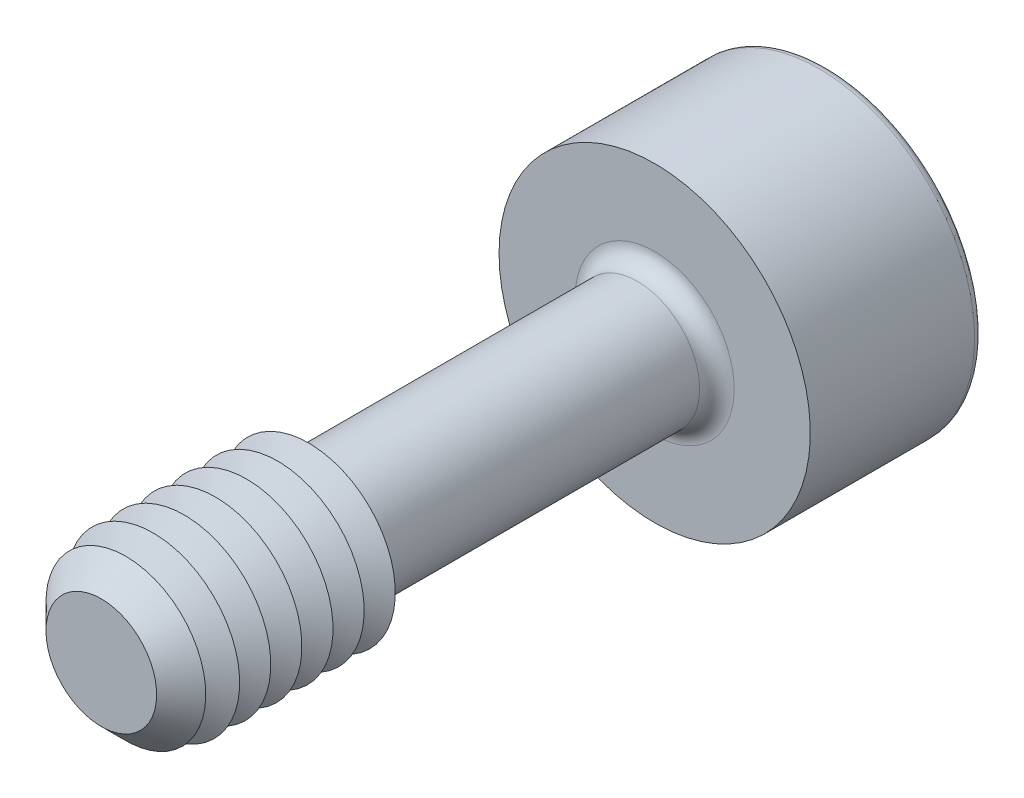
ISO-10303-21;
HEADER;
FILE_DESCRIPTION(('STEP AP214'),'2;1');
FILE_NAME('part.step','',(''),(''),'','','');
FILE_SCHEMA(('AUTOMOTIVE_DESIGN { 1 0 10303 214 1 1 1 1 }'));
ENDSEC;
DATA;
#1=APPLICATION_CONTEXT('core data for automotive mechanical design processes');
#2=APPLICATION_PROTOCOL_DEFINITION('international standard','automotive_design',2000,#1);
#3=PRODUCT_CONTEXT('',#1,'mechanical');
#4=PRODUCT('Part','Part','',(#3));
#5=PRODUCT_RELATED_PRODUCT_CATEGORY('part','',(#4));
#6=PRODUCT_DEFINITION_FORMATION('','',#4);
#7=PRODUCT_DEFINITION_CONTEXT('part definition',#1,'design');
#8=PRODUCT_DEFINITION('design','',#6,#7);
#9=PRODUCT_DEFINITION_SHAPE('','',#8);
#10=(LENGTH_UNIT() NAMED_UNIT(*) SI_UNIT(.MILLI.,.METRE.));
#11=(NAMED_UNIT(*) PLANE_ANGLE_UNIT() SI_UNIT($,.RADIAN.));
#12=(NAMED_UNIT(*) SI_UNIT($,.STERADIAN.) SOLID_ANGLE_UNIT());
#13=UNCERTAINTY_MEASURE_WITH_UNIT(LENGTH_MEASURE(1.E-05),#10,'distance_accuracy_value','');
#14=(GEOMETRIC_REPRESENTATION_CONTEXT(3) GLOBAL_UNCERTAINTY_ASSIGNED_CONTEXT((#13)) GLOBAL_UNIT_ASSIGNED_CONTEXT((#10,
#11,#12)) REPRESENTATION_CONTEXT('',''));
#15=CARTESIAN_POINT('',(0.,0.,0.));
#16=DIRECTION('',(0.,0.,1.));
#17=DIRECTION('',(1.,0.,0.));
#18=AXIS2_PLACEMENT_3D('',#15,#16,#17);
#19=CARTESIAN_POINT('',(-0.577350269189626,-0.999999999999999,-4.5));
#20=DIRECTION('',(0.,0.,1.));
#21=DIRECTION('',(1.,0.,0.));
#22=AXIS2_PLACEMENT_3D('',#19,#20,#21);
#23=PLANE('',#22);
#24=DIRECTION('',(1.,0.,0.));
#25=VECTOR('',#24,1.);
#26=CARTESIAN_POINT('',(-0.577350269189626,-0.999999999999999,-4.5));
#27=LINE('',#26,#25);
#28=CARTESIAN_POINT('',(0.,-0.999999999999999,-4.5));
#29=VERTEX_POINT('',#28);
#30=CARTESIAN_POINT('',(0.577350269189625,-0.999999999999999,-4.5));
#31=VERTEX_POINT('',#30);
#32=EDGE_CURVE('E695',#29,#31,#27,.T.);
#33=ORIENTED_EDGE('',*,*,#32,.F.);
#34=CARTESIAN_POINT('',(0.,0.,-4.5));
#35=DIRECTION('',(0.,0.,1.));
#36=DIRECTION('',(0.,-1.,0.));
#37=AXIS2_PLACEMENT_3D('',#34,#35,#36);
#38=CIRCLE('',#37,1.);
#39=CARTESIAN_POINT('',(0.866025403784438,-0.499999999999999,-4.5));
#40=VERTEX_POINT('',#39);
#41=EDGE_CURVE('E53',#29,#40,#38,.T.);
#42=ORIENTED_EDGE('',*,*,#41,.T.);
#43=DIRECTION('',(0.5,0.866025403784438,0.));
#44=VECTOR('',#43,1.);
#45=CARTESIAN_POINT('',(0.577350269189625,-0.999999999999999,-4.5));
#46=LINE('',#45,#44);
#47=EDGE_CURVE('E681',#31,#40,#46,.T.);
#48=ORIENTED_EDGE('',*,*,#47,.F.);
#49=EDGE_LOOP('',(#33,#42,#48));
#50=FACE_BOUND('',#49,.T.);
#51=ADVANCED_FACE('F41',(#50),#23,.F.);
#52=CARTESIAN_POINT('',(1.15470053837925,0.,-4.5));
#53=VERTEX_POINT('',#52);
#54=EDGE_CURVE('E692',#40,#53,#46,.T.);
#55=ORIENTED_EDGE('',*,*,#54,.F.);
#56=CARTESIAN_POINT('',(0.866025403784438,0.500000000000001,-4.5));
#57=VERTEX_POINT('',#56);
#58=EDGE_CURVE('E11',#40,#57,#38,.T.);
#59=ORIENTED_EDGE('',*,*,#58,.T.);
#60=DIRECTION('',(-0.5,0.866025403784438,0.));
#61=VECTOR('',#60,1.);
#62=CARTESIAN_POINT('',(1.15470053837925,0.,-4.5));
#63=LINE('',#62,#61);
#64=EDGE_CURVE('E680',#53,#57,#63,.T.);
#65=ORIENTED_EDGE('',*,*,#64,.F.);
#66=EDGE_LOOP('',(#55,#59,#65));
#67=FACE_BOUND('',#66,.T.);
#68=ADVANCED_FACE('F133',(#67),#23,.F.);
#69=CARTESIAN_POINT('',(0.577350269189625,1.,-4.5));
#70=VERTEX_POINT('',#69);
#71=EDGE_CURVE('E675',#57,#70,#63,.T.);
#72=ORIENTED_EDGE('',*,*,#71,.F.);
#73=CARTESIAN_POINT('',(0.,1.,-4.5));
#74=VERTEX_POINT('',#73);
#75=EDGE_CURVE('E51',#57,#74,#38,.T.);
#76=ORIENTED_EDGE('',*,*,#75,.T.);
#77=DIRECTION('',(-1.,0.,0.));
#78=VECTOR('',#77,1.);
#79=CARTESIAN_POINT('',(0.577350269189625,1.,-4.5));
#80=LINE('',#79,#78);
#81=EDGE_CURVE('E177',#70,#74,#80,.T.);
#82=ORIENTED_EDGE('',*,*,#81,.F.);
#83=EDGE_LOOP('',(#72,#76,#82));
#84=FACE_BOUND('',#83,.T.);
#85=ADVANCED_FACE('F139',(#84),#23,.F.);
#86=CARTESIAN_POINT('',(-0.577350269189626,1.,-4.5));
#87=VERTEX_POINT('',#86);
#88=EDGE_CURVE('E686',#74,#87,#80,.T.);
#89=ORIENTED_EDGE('',*,*,#88,.F.);
#90=CARTESIAN_POINT('',(-0.866025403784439,0.500000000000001,-4.5));
#91=VERTEX_POINT('',#90);
#92=EDGE_CURVE('E264',#74,#91,#38,.T.);
#93=ORIENTED_EDGE('',*,*,#92,.T.);
#94=DIRECTION('',(-0.5,-0.866025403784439,0.));
#95=VECTOR('',#94,1.);
#96=CARTESIAN_POINT('',(-0.577350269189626,1.,-4.5));
#97=LINE('',#96,#95);
#98=EDGE_CURVE('E176',#87,#91,#97,.T.);
#99=ORIENTED_EDGE('',*,*,#98,.F.);
#100=EDGE_LOOP('',(#89,#93,#99));
#101=FACE_BOUND('',#100,.T.);
#102=ADVANCED_FACE('F157',(#101),#23,.F.);
#103=CARTESIAN_POINT('',(-1.15470053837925,0.,-4.5));
#104=VERTEX_POINT('',#103);
#105=EDGE_CURVE('E170',#91,#104,#97,.T.);
#106=ORIENTED_EDGE('',*,*,#105,.F.);
#107=CARTESIAN_POINT('',(-0.866025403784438,-0.5,-4.5));
#108=VERTEX_POINT('',#107);
#109=EDGE_CURVE('E172',#91,#108,#38,.T.);
#110=ORIENTED_EDGE('',*,*,#109,.T.);
#111=DIRECTION('',(0.500000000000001,-0.866025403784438,0.));
#112=VECTOR('',#111,1.);
#113=CARTESIAN_POINT('',(-1.15470053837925,0.,-4.5));
#114=LINE('',#113,#112);
#115=EDGE_CURVE('E174',#104,#108,#114,.T.);
#116=ORIENTED_EDGE('',*,*,#115,.F.);
#117=EDGE_LOOP('',(#106,#110,#116));
#118=FACE_BOUND('',#117,.T.);
#119=ADVANCED_FACE('F146',(#118),#23,.F.);
#120=CARTESIAN_POINT('',(0.,0.,-6.5));
#121=DIRECTION('',(0.,0.,-1.));
#122=DIRECTION('',(-1.,0.,0.));
#123=AXIS2_PLACEMENT_3D('',#120,#121,#122);
#124=PLANE('',#123);
#125=CARTESIAN_POINT('',(0.,0.,-6.5));
#126=DIRECTION('',(0.,0.,-1.));
#127=DIRECTION('',(-1.,0.,0.));
#128=AXIS2_PLACEMENT_3D('',#125,#126,#127);
#129=CIRCLE('',#128,2.125);
#130=CARTESIAN_POINT('',(-2.125,0.,-6.5));
#131=VERTEX_POINT('',#130);
#132=EDGE_CURVE('E250',#131,#131,#129,.T.);
#133=ORIENTED_EDGE('',*,*,#132,.T.);
#134=EDGE_LOOP('',(#133));
#135=FACE_BOUND('',#134,.T.);
#136=DIRECTION('',(-0.5,-0.866025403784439,0.));
#137=VECTOR('',#136,1.);
#138=CARTESIAN_POINT('',(-0.577350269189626,1.,-6.5));
#139=LINE('',#138,#137);
#140=CARTESIAN_POINT('',(-0.577350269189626,1.,-6.5));
#141=VERTEX_POINT('',#140);
#142=CARTESIAN_POINT('',(-1.15470053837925,0.,-6.5));
#143=VERTEX_POINT('',#142);
#144=EDGE_CURVE('E211',#141,#143,#139,.T.);
#145=ORIENTED_EDGE('',*,*,#144,.T.);
#146=DIRECTION('',(0.500000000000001,-0.866025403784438,0.));
#147=VECTOR('',#146,1.);
#148=CARTESIAN_POINT('',(-1.15470053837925,0.,-6.5));
#149=LINE('',#148,#147);
#150=CARTESIAN_POINT('',(-0.577350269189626,-0.999999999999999,-6.5));
#151=VERTEX_POINT('',#150);
#152=EDGE_CURVE('E67',#143,#151,#149,.T.);
#153=ORIENTED_EDGE('',*,*,#152,.T.);
#154=DIRECTION('',(1.,0.,0.));
#155=VECTOR('',#154,1.);
#156=CARTESIAN_POINT('',(-0.577350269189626,-0.999999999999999,-6.5));
#157=LINE('',#156,#155);
#158=CARTESIAN_POINT('',(0.577350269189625,-0.999999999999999,-6.5));
#159=VERTEX_POINT('',#158);
#160=EDGE_CURVE('E195',#151,#159,#157,.T.);
#161=ORIENTED_EDGE('',*,*,#160,.T.);
#162=DIRECTION('',(0.5,0.866025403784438,0.));
#163=VECTOR('',#162,1.);
#164=CARTESIAN_POINT('',(0.577350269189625,-0.999999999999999,-6.5));
#165=LINE('',#164,#163);
#166=CARTESIAN_POINT('',(1.15470053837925,0.,-6.5));
#167=VERTEX_POINT('',#166);
#168=EDGE_CURVE('E199',#159,#167,#165,.T.);
#169=ORIENTED_EDGE('',*,*,#168,.T.);
#170=DIRECTION('',(-0.5,0.866025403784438,0.));
#171=VECTOR('',#170,1.);
#172=CARTESIAN_POINT('',(1.15470053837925,0.,-6.5));
#173=LINE('',#172,#171);
#174=CARTESIAN_POINT('',(0.577350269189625,1.,-6.5));
#175=VERTEX_POINT('',#174);
#176=EDGE_CURVE('E203',#167,#175,#173,.T.);
#177=ORIENTED_EDGE('',*,*,#176,.T.);
#178=DIRECTION('',(-1.,0.,0.));
#179=VECTOR('',#178,1.);
#180=CARTESIAN_POINT('',(0.577350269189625,1.,-6.5));
#181=LINE('',#180,#179);
#182=EDGE_CURVE('E207',#175,#141,#181,.T.);
#183=ORIENTED_EDGE('',*,*,#182,.T.);
#184=EDGE_LOOP('',(#145,#153,#161,#169,#177,#183));
#185=FACE_BOUND('',#184,.T.);
#186=ADVANCED_FACE('F156',(#135,#185),#124,.T.);
#187=CARTESIAN_POINT('',(0.,0.,4.));
#188=DIRECTION('',(0.,0.,-1.));
#189=DIRECTION('',(-1.,0.,0.));
#190=AXIS2_PLACEMENT_3D('',#187,#188,#189);
#191=CYLINDRICAL_SURFACE('',#190,0.9);
#192=CARTESIAN_POINT('',(0.,0.,-3.75));
#193=DIRECTION('',(0.,0.,-1.));
#194=DIRECTION('',(-1.,0.,0.));
#195=AXIS2_PLACEMENT_3D('',#192,#193,#194);
#196=CIRCLE('',#195,0.9);
#197=CARTESIAN_POINT('',(-0.9,0.,-3.75));
#198=VERTEX_POINT('',#197);
#199=EDGE_CURVE('E246',#198,#198,#196,.F.);
#200=ORIENTED_EDGE('',*,*,#199,.T.);
#201=EDGE_LOOP('',(#200));
#202=FACE_BOUND('',#201,.T.);
#203=CARTESIAN_POINT('',(0.,0.,0.797927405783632));
#204=DIRECTION('',(0.,0.,-1.));
#205=DIRECTION('',(0.,1.,0.));
#206=AXIS2_PLACEMENT_3D('',#203,#204,#205);
#207=CIRCLE('',#206,0.9);
#208=CARTESIAN_POINT('',(0.,0.9,0.797927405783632));
#209=VERTEX_POINT('',#208);
#210=EDGE_CURVE('E234',#209,#209,#207,.T.);
#211=ORIENTED_EDGE('',*,*,#210,.T.);
#212=EDGE_LOOP('',(#211));
#213=FACE_BOUND('',#212,.T.);
#214=ADVANCED_FACE('F163',(#202,#213),#191,.T.);
#215=CARTESIAN_POINT('',(0.,0.,0.797927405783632));
#216=DIRECTION('',(0.,0.,1.));
#217=DIRECTION('',(0.,-1.,0.));
#218=AXIS2_PLACEMENT_3D('',#215,#216,#217);
#219=CONICAL_SURFACE('',#218,0.9,1.0471975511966);
#220=CARTESIAN_POINT('',(0.,0.,1.));
#221=DIRECTION('',(0.,0.,-1.));
#222=DIRECTION('',(-1.,0.,0.));
#223=AXIS2_PLACEMENT_3D('',#220,#221,#222);
#224=CIRCLE('',#223,1.25);
#225=CARTESIAN_POINT('',(-1.25,0.,1.));
#226=VERTEX_POINT('',#225);
#227=EDGE_CURVE('E268',#226,#226,#224,.T.);
#228=ORIENTED_EDGE('',*,*,#227,.T.);
#229=EDGE_LOOP('',(#228));
#230=FACE_BOUND('',#229,.T.);
#231=ORIENTED_EDGE('',*,*,#210,.F.);
#232=EDGE_LOOP('',(#231));
#233=FACE_BOUND('',#232,.T.);
#234=ADVANCED_FACE('F460',(#230,#233),#219,.T.);
#235=CARTESIAN_POINT('',(0.,0.,-4.));
#236=DIRECTION('',(0.,0.,-1.));
#237=DIRECTION('',(-1.,0.,0.));
#238=AXIS2_PLACEMENT_3D('',#235,#236,#237);
#239=PLANE('',#238);
#240=CARTESIAN_POINT('',(0.,0.,-4.));
#241=DIRECTION('',(0.,0.,-1.));
#242=DIRECTION('',(-1.,0.,0.));
#243=AXIS2_PLACEMENT_3D('',#240,#241,#242);
#244=CIRCLE('',#243,1.15);
#245=CARTESIAN_POINT('',(-1.15,0.,-4.));
#246=VERTEX_POINT('',#245);
#247=EDGE_CURVE('E242',#246,#246,#244,.T.);
#248=ORIENTED_EDGE('',*,*,#247,.T.);
#249=EDGE_LOOP('',(#248));
#250=FACE_BOUND('',#249,.T.);
#251=CARTESIAN_POINT('',(0.,0.,-4.));
#252=DIRECTION('',(0.,0.,-1.));
#253=DIRECTION('',(-1.,0.,0.));
#254=AXIS2_PLACEMENT_3D('',#251,#252,#253);
#255=CIRCLE('',#254,2.25);
#256=CARTESIAN_POINT('',(-2.25,0.,-4.));
#257=VERTEX_POINT('',#256);
#258=EDGE_CURVE('E230',#257,#257,#255,.T.);
#259=ORIENTED_EDGE('',*,*,#258,.F.);
#260=EDGE_LOOP('',(#259));
#261=FACE_BOUND('',#260,.T.);
#262=ADVANCED_FACE('F453',(#250,#261),#239,.F.);
#263=CARTESIAN_POINT('',(0.,0.,-6.5));
#264=DIRECTION('',(0.,0.,1.));
#265=DIRECTION('',(1.,0.,0.));
#266=AXIS2_PLACEMENT_3D('',#263,#264,#265);
#267=CYLINDRICAL_SURFACE('',#266,2.25);
#268=CARTESIAN_POINT('',(0.,0.,-6.375));
#269=DIRECTION('',(0.,0.,-1.));
#270=DIRECTION('',(-1.,0.,0.));
#271=AXIS2_PLACEMENT_3D('',#268,#269,#270);
#272=CIRCLE('',#271,2.25);
#273=CARTESIAN_POINT('',(-2.25,0.,-6.375));
#274=VERTEX_POINT('',#273);
#275=EDGE_CURVE('E253',#274,#274,#272,.F.);
#276=ORIENTED_EDGE('',*,*,#275,.T.);
#277=EDGE_LOOP('',(#276));
#278=FACE_BOUND('',#277,.T.);
#279=ORIENTED_EDGE('',*,*,#258,.T.);
#280=EDGE_LOOP('',(#279));
#281=FACE_BOUND('',#280,.T.);
#282=ADVANCED_FACE('F459',(#278,#281),#267,.T.);
#283=CARTESIAN_POINT('',(-1.15470053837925,0.,-4.5));
#284=DIRECTION('',(0.866025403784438,0.500000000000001,0.));
#285=DIRECTION('',(-0.500000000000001,0.866025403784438,0.));
#286=AXIS2_PLACEMENT_3D('',#283,#284,#285);
#287=PLANE('',#286);
#288=ORIENTED_EDGE('',*,*,#152,.F.);
#289=DIRECTION('',(0.,0.,-1.));
#290=VECTOR('',#289,1.);
#291=CARTESIAN_POINT('',(-1.15470053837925,0.,-4.5));
#292=LINE('',#291,#290);
#293=EDGE_CURVE('E186',#104,#143,#292,.T.);
#294=ORIENTED_EDGE('',*,*,#293,.F.);
#295=ORIENTED_EDGE('',*,*,#115,.T.);
#296=CARTESIAN_POINT('',(-0.577350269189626,-0.999999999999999,-4.5));
#297=VERTEX_POINT('',#296);
#298=EDGE_CURVE('E214',#108,#297,#114,.T.);
#299=ORIENTED_EDGE('',*,*,#298,.T.);
#300=DIRECTION('',(0.,0.,-1.));
#301=VECTOR('',#300,1.);
#302=CARTESIAN_POINT('',(-0.577350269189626,-0.999999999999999,-4.5));
#303=LINE('',#302,#301);
#304=EDGE_CURVE('E227',#297,#151,#303,.T.);
#305=ORIENTED_EDGE('',*,*,#304,.T.);
#306=EDGE_LOOP('',(#288,#294,#295,#299,#305));
#307=FACE_BOUND('',#306,.T.);
#308=ADVANCED_FACE('F471',(#307),#287,.T.);
#309=CARTESIAN_POINT('',(-0.577350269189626,-0.999999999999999,-4.5));
#310=DIRECTION('',(0.,1.,0.));
#311=DIRECTION('',(-1.,0.,0.));
#312=AXIS2_PLACEMENT_3D('',#309,#310,#311);
#313=PLANE('',#312);
#314=ORIENTED_EDGE('',*,*,#160,.F.);
#315=ORIENTED_EDGE('',*,*,#304,.F.);
#316=EDGE_CURVE('E693',#297,#29,#27,.T.);
#317=ORIENTED_EDGE('',*,*,#316,.T.);
#318=ORIENTED_EDGE('',*,*,#32,.T.);
#319=DIRECTION('',(0.,0.,-1.));
#320=VECTOR('',#319,1.);
#321=CARTESIAN_POINT('',(0.577350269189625,-0.999999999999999,-4.5));
#322=LINE('',#321,#320);
#323=EDGE_CURVE('E224',#31,#159,#322,.T.);
#324=ORIENTED_EDGE('',*,*,#323,.T.);
#325=EDGE_LOOP('',(#314,#315,#317,#318,#324));
#326=FACE_BOUND('',#325,.T.);
#327=ADVANCED_FACE('F487',(#326),#313,.T.);
#328=CARTESIAN_POINT('',(0.577350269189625,-0.999999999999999,-4.5));
#329=DIRECTION('',(-0.866025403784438,0.5,0.));
#330=DIRECTION('',(-0.5,-0.866025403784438,0.));
#331=AXIS2_PLACEMENT_3D('',#328,#329,#330);
#332=PLANE('',#331);
#333=ORIENTED_EDGE('',*,*,#168,.F.);
#334=ORIENTED_EDGE('',*,*,#323,.F.);
#335=ORIENTED_EDGE('',*,*,#47,.T.);
#336=ORIENTED_EDGE('',*,*,#54,.T.);
#337=DIRECTION('',(0.,0.,-1.));
#338=VECTOR('',#337,1.);
#339=CARTESIAN_POINT('',(1.15470053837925,0.,-4.5));
#340=LINE('',#339,#338);
#341=EDGE_CURVE('E221',#53,#167,#340,.T.);
#342=ORIENTED_EDGE('',*,*,#341,.T.);
#343=EDGE_LOOP('',(#333,#334,#335,#336,#342));
#344=FACE_BOUND('',#343,.T.);
#345=ADVANCED_FACE('F497',(#344),#332,.T.);
#346=CARTESIAN_POINT('',(1.15470053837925,0.,-4.5));
#347=DIRECTION('',(-0.866025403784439,-0.5,0.));
#348=DIRECTION('',(0.5,-0.866025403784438,0.));
#349=AXIS2_PLACEMENT_3D('',#346,#347,#348);
#350=PLANE('',#349);
#351=ORIENTED_EDGE('',*,*,#176,.F.);
#352=ORIENTED_EDGE('',*,*,#341,.F.);
#353=ORIENTED_EDGE('',*,*,#64,.T.);
#354=ORIENTED_EDGE('',*,*,#71,.T.);
#355=DIRECTION('',(0.,0.,-1.));
#356=VECTOR('',#355,1.);
#357=CARTESIAN_POINT('',(0.577350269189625,1.,-4.5));
#358=LINE('',#357,#356);
#359=EDGE_CURVE('E218',#70,#175,#358,.T.);
#360=ORIENTED_EDGE('',*,*,#359,.T.);
#361=EDGE_LOOP('',(#351,#352,#353,#354,#360));
#362=FACE_BOUND('',#361,.T.);
#363=ADVANCED_FACE('F507',(#362),#350,.T.);
#364=CARTESIAN_POINT('',(0.577350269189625,1.,-4.5));
#365=DIRECTION('',(0.,-1.,0.));
#366=DIRECTION('',(1.,0.,0.));
#367=AXIS2_PLACEMENT_3D('',#364,#365,#366);
#368=PLANE('',#367);
#369=ORIENTED_EDGE('',*,*,#182,.F.);
#370=ORIENTED_EDGE('',*,*,#359,.F.);
#371=ORIENTED_EDGE('',*,*,#81,.T.);
#372=ORIENTED_EDGE('',*,*,#88,.T.);
#373=DIRECTION('',(0.,0.,-1.));
#374=VECTOR('',#373,1.);
#375=CARTESIAN_POINT('',(-0.577350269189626,1.,-4.5));
#376=LINE('',#375,#374);
#377=EDGE_CURVE('E182',#87,#141,#376,.T.);
#378=ORIENTED_EDGE('',*,*,#377,.T.);
#379=EDGE_LOOP('',(#369,#370,#371,#372,#378));
#380=FACE_BOUND('',#379,.T.);
#381=ADVANCED_FACE('F152',(#380),#368,.T.);
#382=CARTESIAN_POINT('',(-0.577350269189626,1.,-4.5));
#383=DIRECTION('',(0.866025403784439,-0.5,0.));
#384=DIRECTION('',(0.5,0.866025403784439,0.));
#385=AXIS2_PLACEMENT_3D('',#382,#383,#384);
#386=PLANE('',#385);
#387=ORIENTED_EDGE('',*,*,#144,.F.);
#388=ORIENTED_EDGE('',*,*,#377,.F.);
#389=ORIENTED_EDGE('',*,*,#98,.T.);
#390=ORIENTED_EDGE('',*,*,#105,.T.);
#391=ORIENTED_EDGE('',*,*,#293,.T.);
#392=EDGE_LOOP('',(#387,#388,#389,#390,#391));
#393=FACE_BOUND('',#392,.T.);
#394=ADVANCED_FACE('F144',(#393),#386,.T.);
#395=ORIENTED_EDGE('',*,*,#298,.F.);
#396=EDGE_CURVE('E256',#108,#29,#38,.T.);
#397=ORIENTED_EDGE('',*,*,#396,.T.);
#398=ORIENTED_EDGE('',*,*,#316,.F.);
#399=EDGE_LOOP('',(#395,#397,#398));
#400=FACE_BOUND('',#399,.T.);
#401=ADVANCED_FACE('F135',(#400),#23,.F.);
#402=CARTESIAN_POINT('',(0.,0.,-3.75));
#403=DIRECTION('',(0.,0.,-1.));
#404=DIRECTION('',(-1.,0.,0.));
#405=AXIS2_PLACEMENT_3D('',#402,#403,#404);
#406=TOROIDAL_SURFACE('',#405,1.15,0.25);
#407=ORIENTED_EDGE('',*,*,#199,.F.);
#408=EDGE_LOOP('',(#407));
#409=FACE_BOUND('',#408,.T.);
#410=ORIENTED_EDGE('',*,*,#247,.F.);
#411=EDGE_LOOP('',(#410));
#412=FACE_BOUND('',#411,.T.);
#413=ADVANCED_FACE('F129',(#409,#412),#406,.F.);
#414=CARTESIAN_POINT('',(0.,0.,-6.375));
#415=DIRECTION('',(0.,0.,-1.));
#416=DIRECTION('',(-1.,0.,0.));
#417=AXIS2_PLACEMENT_3D('',#414,#415,#416);
#418=TOROIDAL_SURFACE('',#417,2.125,0.125);
#419=ORIENTED_EDGE('',*,*,#275,.F.);
#420=EDGE_LOOP('',(#419));
#421=FACE_BOUND('',#420,.T.);
#422=ORIENTED_EDGE('',*,*,#132,.F.);
#423=EDGE_LOOP('',(#422));
#424=FACE_BOUND('',#423,.T.);
#425=ADVANCED_FACE('F43',(#421,#424),#418,.T.);
#426=CARTESIAN_POINT('',(0.,0.,-3.92264973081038));
#427=DIRECTION('',(0.,0.,-1.));
#428=DIRECTION('',(0.,1.,0.));
#429=AXIS2_PLACEMENT_3D('',#426,#427,#428);
#430=CONICAL_SURFACE('',#429,0.,1.04719755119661);
#431=ORIENTED_EDGE('',*,*,#41,.F.);
#432=ORIENTED_EDGE('',*,*,#396,.F.);
#433=ORIENTED_EDGE('',*,*,#109,.F.);
#434=ORIENTED_EDGE('',*,*,#92,.F.);
#435=ORIENTED_EDGE('',*,*,#75,.F.);
#436=ORIENTED_EDGE('',*,*,#58,.F.);
#437=EDGE_LOOP('',(#431,#432,#433,#434,#435,#436));
#438=FACE_BOUND('',#437,.T.);
#439=CARTESIAN_POINT('',(0.,0.,-3.92264973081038));
#440=VERTEX_POINT('',#439);
#441=VERTEX_LOOP('',#440);
#442=FACE_BOUND('',#441,.T.);
#443=ADVANCED_FACE('F118',(#438,#442),#430,.F.);
#444=CARTESIAN_POINT('',(0.,0.,1.225));
#445=DIRECTION('',(0.,0.,-1.));
#446=DIRECTION('',(-1.,0.,0.));
#447=AXIS2_PLACEMENT_3D('',#444,#445,#446);
#448=CONICAL_SURFACE('',#447,0.860288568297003,1.0471975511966);
#449=ORIENTED_EDGE('',*,*,#227,.F.);
#450=EDGE_LOOP('',(#449));
#451=FACE_BOUND('',#450,.T.);
#452=CARTESIAN_POINT('',(0.,0.,1.225));
#453=DIRECTION('',(0.,0.,-1.));
#454=DIRECTION('',(-1.,0.,0.));
#455=AXIS2_PLACEMENT_3D('',#452,#453,#454);
#456=CIRCLE('',#455,0.860288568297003);
#457=CARTESIAN_POINT('',(-0.860288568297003,0.,1.225));
#458=VERTEX_POINT('',#457);
#459=EDGE_CURVE('E274',#458,#458,#456,.T.);
#460=ORIENTED_EDGE('',*,*,#459,.T.);
#461=EDGE_LOOP('',(#460));
#462=FACE_BOUND('',#461,.T.);
#463=ADVANCED_FACE('F120',(#451,#462),#448,.T.);
#464=CARTESIAN_POINT('',(0.,0.,1.45));
#465=DIRECTION('',(0.,0.,1.));
#466=DIRECTION('',(1.,0.,0.));
#467=AXIS2_PLACEMENT_3D('',#464,#465,#466);
#468=CONICAL_SURFACE('',#467,1.25,1.0471975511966);
#469=ORIENTED_EDGE('',*,*,#459,.F.);
#470=EDGE_LOOP('',(#469));
#471=FACE_BOUND('',#470,.T.);
#472=CARTESIAN_POINT('',(0.,0.,1.45));
#473=DIRECTION('',(0.,0.,-1.));
#474=DIRECTION('',(-1.,0.,0.));
#475=AXIS2_PLACEMENT_3D('',#472,#473,#474);
#476=CIRCLE('',#475,1.25);
#477=CARTESIAN_POINT('',(-1.25,0.,1.45));
#478=VERTEX_POINT('',#477);
#479=EDGE_CURVE('E280',#478,#478,#476,.T.);
#480=ORIENTED_EDGE('',*,*,#479,.T.);
#481=EDGE_LOOP('',(#480));
#482=FACE_BOUND('',#481,.T.);
#483=ADVANCED_FACE('F126',(#471,#482),#468,.T.);
#484=CARTESIAN_POINT('',(0.,0.,1.675));
#485=DIRECTION('',(0.,0.,-1.));
#486=DIRECTION('',(-1.,0.,0.));
#487=AXIS2_PLACEMENT_3D('',#484,#485,#486);
#488=CONICAL_SURFACE('',#487,0.860288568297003,1.0471975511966);
#489=ORIENTED_EDGE('',*,*,#479,.F.);
#490=EDGE_LOOP('',(#489));
#491=FACE_BOUND('',#490,.T.);
#492=CARTESIAN_POINT('',(0.,0.,1.675));
#493=DIRECTION('',(0.,0.,-1.));
#494=DIRECTION('',(-1.,0.,0.));
#495=AXIS2_PLACEMENT_3D('',#492,#493,#494);
#496=CIRCLE('',#495,0.860288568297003);
#497=CARTESIAN_POINT('',(-0.860288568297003,0.,1.675));
#498=VERTEX_POINT('',#497);
#499=EDGE_CURVE('E286',#498,#498,#496,.T.);
#500=ORIENTED_EDGE('',*,*,#499,.T.);
#501=EDGE_LOOP('',(#500));
#502=FACE_BOUND('',#501,.T.);
#503=ADVANCED_FACE('F367',(#491,#502),#488,.T.);
#504=CARTESIAN_POINT('',(0.,0.,1.9));
#505=DIRECTION('',(0.,0.,1.));
#506=DIRECTION('',(1.,0.,0.));
#507=AXIS2_PLACEMENT_3D('',#504,#505,#506);
#508=CONICAL_SURFACE('',#507,1.25,1.0471975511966);
#509=ORIENTED_EDGE('',*,*,#499,.F.);
#510=EDGE_LOOP('',(#509));
#511=FACE_BOUND('',#510,.T.);
#512=CARTESIAN_POINT('',(0.,0.,1.9));
#513=DIRECTION('',(0.,0.,-1.));
#514=DIRECTION('',(-1.,0.,0.));
#515=AXIS2_PLACEMENT_3D('',#512,#513,#514);
#516=CIRCLE('',#515,1.25);
#517=CARTESIAN_POINT('',(-1.25,0.,1.9));
#518=VERTEX_POINT('',#517);
#519=EDGE_CURVE('E290',#518,#518,#516,.T.);
#520=ORIENTED_EDGE('',*,*,#519,.T.);
#521=EDGE_LOOP('',(#520));
#522=FACE_BOUND('',#521,.T.);
#523=ADVANCED_FACE('F363',(#511,#522),#508,.T.);
#524=CARTESIAN_POINT('',(0.,0.,2.125));
#525=DIRECTION('',(0.,0.,-1.));
#526=DIRECTION('',(-1.,0.,0.));
#527=AXIS2_PLACEMENT_3D('',#524,#525,#526);
#528=CONICAL_SURFACE('',#527,0.860288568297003,1.0471975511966);
#529=ORIENTED_EDGE('',*,*,#519,.F.);
#530=EDGE_LOOP('',(#529));
#531=FACE_BOUND('',#530,.T.);
#532=CARTESIAN_POINT('',(0.,0.,2.125));
#533=DIRECTION('',(0.,0.,-1.));
#534=DIRECTION('',(-1.,0.,0.));
#535=AXIS2_PLACEMENT_3D('',#532,#533,#534);
#536=CIRCLE('',#535,0.860288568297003);
#537=CARTESIAN_POINT('',(-0.860288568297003,0.,2.125));
#538=VERTEX_POINT('',#537);
#539=EDGE_CURVE('E294',#538,#538,#536,.T.);
#540=ORIENTED_EDGE('',*,*,#539,.T.);
#541=EDGE_LOOP('',(#540));
#542=FACE_BOUND('',#541,.T.);
#543=ADVANCED_FACE('F359',(#531,#542),#528,.T.);
#544=CARTESIAN_POINT('',(0.,0.,2.35));
#545=DIRECTION('',(0.,0.,1.));
#546=DIRECTION('',(1.,0.,0.));
#547=AXIS2_PLACEMENT_3D('',#544,#545,#546);
#548=CONICAL_SURFACE('',#547,1.25,1.0471975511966);
#549=ORIENTED_EDGE('',*,*,#539,.F.);
#550=EDGE_LOOP('',(#549));
#551=FACE_BOUND('',#550,.T.);
#552=CARTESIAN_POINT('',(0.,0.,2.35));
#553=DIRECTION('',(0.,0.,-1.));
#554=DIRECTION('',(-1.,0.,0.));
#555=AXIS2_PLACEMENT_3D('',#552,#553,#554);
#556=CIRCLE('',#555,1.25);
#557=CARTESIAN_POINT('',(-1.25,0.,2.35));
#558=VERTEX_POINT('',#557);
#559=EDGE_CURVE('E298',#558,#558,#556,.T.);
#560=ORIENTED_EDGE('',*,*,#559,.T.);
#561=EDGE_LOOP('',(#560));
#562=FACE_BOUND('',#561,.T.);
#563=ADVANCED_FACE('F355',(#551,#562),#548,.T.);
#564=CARTESIAN_POINT('',(0.,0.,2.575));
#565=DIRECTION('',(0.,0.,-1.));
#566=DIRECTION('',(-1.,0.,0.));
#567=AXIS2_PLACEMENT_3D('',#564,#565,#566);
#568=CONICAL_SURFACE('',#567,0.860288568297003,1.0471975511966);
#569=ORIENTED_EDGE('',*,*,#559,.F.);
#570=EDGE_LOOP('',(#569));
#571=FACE_BOUND('',#570,.T.);
#572=CARTESIAN_POINT('',(0.,0.,2.575));
#573=DIRECTION('',(0.,0.,-1.));
#574=DIRECTION('',(-1.,0.,0.));
#575=AXIS2_PLACEMENT_3D('',#572,#573,#574);
#576=CIRCLE('',#575,0.860288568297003);
#577=CARTESIAN_POINT('',(-0.860288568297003,0.,2.575));
#578=VERTEX_POINT('',#577);
#579=EDGE_CURVE('E301',#578,#578,#576,.T.);
#580=ORIENTED_EDGE('',*,*,#579,.T.);
#581=EDGE_LOOP('',(#580));
#582=FACE_BOUND('',#581,.T.);
#583=ADVANCED_FACE('F351',(#571,#582),#568,.T.);
#584=CARTESIAN_POINT('',(0.,0.,2.8));
#585=DIRECTION('',(0.,0.,1.));
#586=DIRECTION('',(1.,0.,0.));
#587=AXIS2_PLACEMENT_3D('',#584,#585,#586);
#588=CONICAL_SURFACE('',#587,1.25,1.0471975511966);
#589=ORIENTED_EDGE('',*,*,#579,.F.);
#590=EDGE_LOOP('',(#589));
#591=FACE_BOUND('',#590,.T.);
#592=CARTESIAN_POINT('',(0.,0.,2.8));
#593=DIRECTION('',(0.,0.,-1.));
#594=DIRECTION('',(-1.,0.,0.));
#595=AXIS2_PLACEMENT_3D('',#592,#593,#594);
#596=CIRCLE('',#595,1.25);
#597=CARTESIAN_POINT('',(-1.25,0.,2.8));
#598=VERTEX_POINT('',#597);
#599=EDGE_CURVE('E305',#598,#598,#596,.T.);
#600=ORIENTED_EDGE('',*,*,#599,.T.);
#601=EDGE_LOOP('',(#600));
#602=FACE_BOUND('',#601,.T.);
#603=ADVANCED_FACE('F347',(#591,#602),#588,.T.);
#604=CARTESIAN_POINT('',(0.,0.,3.025));
#605=DIRECTION('',(0.,0.,-1.));
#606=DIRECTION('',(-1.,0.,0.));
#607=AXIS2_PLACEMENT_3D('',#604,#605,#606);
#608=CONICAL_SURFACE('',#607,0.860288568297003,1.0471975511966);
#609=ORIENTED_EDGE('',*,*,#599,.F.);
#610=EDGE_LOOP('',(#609));
#611=FACE_BOUND('',#610,.T.);
#612=CARTESIAN_POINT('',(0.,0.,3.025));
#613=DIRECTION('',(0.,0.,-1.));
#614=DIRECTION('',(-1.,0.,0.));
#615=AXIS2_PLACEMENT_3D('',#612,#613,#614);
#616=CIRCLE('',#615,0.860288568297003);
#617=CARTESIAN_POINT('',(-0.860288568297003,0.,3.025));
#618=VERTEX_POINT('',#617);
#619=EDGE_CURVE('E309',#618,#618,#616,.T.);
#620=ORIENTED_EDGE('',*,*,#619,.T.);
#621=EDGE_LOOP('',(#620));
#622=FACE_BOUND('',#621,.T.);
#623=ADVANCED_FACE('F343',(#611,#622),#608,.T.);
#624=CARTESIAN_POINT('',(0.,0.,3.25));
#625=DIRECTION('',(0.,0.,1.));
#626=DIRECTION('',(1.,0.,0.));
#627=AXIS2_PLACEMENT_3D('',#624,#625,#626);
#628=CONICAL_SURFACE('',#627,1.25,1.0471975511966);
#629=ORIENTED_EDGE('',*,*,#619,.F.);
#630=EDGE_LOOP('',(#629));
#631=FACE_BOUND('',#630,.T.);
#632=CARTESIAN_POINT('',(0.,0.,3.25));
#633=DIRECTION('',(0.,0.,-1.));
#634=DIRECTION('',(-1.,0.,0.));
#635=AXIS2_PLACEMENT_3D('',#632,#633,#634);
#636=CIRCLE('',#635,1.25);
#637=CARTESIAN_POINT('',(-1.25,0.,3.25));
#638=VERTEX_POINT('',#637);
#639=EDGE_CURVE('E313',#638,#638,#636,.T.);
#640=ORIENTED_EDGE('',*,*,#639,.T.);
#641=EDGE_LOOP('',(#640));
#642=FACE_BOUND('',#641,.T.);
#643=ADVANCED_FACE('F336',(#631,#642),#628,.T.);
#644=CARTESIAN_POINT('',(0.,0.,3.475));
#645=DIRECTION('',(0.,0.,-1.));
#646=DIRECTION('',(-1.,0.,0.));
#647=AXIS2_PLACEMENT_3D('',#644,#645,#646);
#648=CONICAL_SURFACE('',#647,0.860288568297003,1.0471975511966);
#649=ORIENTED_EDGE('',*,*,#639,.F.);
#650=EDGE_LOOP('',(#649));
#651=FACE_BOUND('',#650,.T.);
#652=CARTESIAN_POINT('',(0.,0.,3.475));
#653=DIRECTION('',(0.,0.,-1.));
#654=DIRECTION('',(-1.,0.,0.));
#655=AXIS2_PLACEMENT_3D('',#652,#653,#654);
#656=CIRCLE('',#655,0.860288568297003);
#657=CARTESIAN_POINT('',(-0.860288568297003,0.,3.475));
#658=VERTEX_POINT('',#657);
#659=EDGE_CURVE('E317',#658,#658,#656,.T.);
#660=ORIENTED_EDGE('',*,*,#659,.T.);
#661=EDGE_LOOP('',(#660));
#662=FACE_BOUND('',#661,.T.);
#663=ADVANCED_FACE('F322',(#651,#662),#648,.T.);
#664=CARTESIAN_POINT('',(0.,0.,3.7));
#665=DIRECTION('',(0.,0.,1.));
#666=DIRECTION('',(1.,0.,0.));
#667=AXIS2_PLACEMENT_3D('',#664,#665,#666);
#668=CONICAL_SURFACE('',#667,1.25,1.0471975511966);
#669=CARTESIAN_POINT('',(0.,0.,3.64509618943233));
#670=DIRECTION('',(0.,0.,1.));
#671=DIRECTION('',(1.,0.,0.));
#672=AXIS2_PLACEMENT_3D('',#669,#670,#671);
#673=CIRCLE('',#672,1.15490381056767);
#674=CARTESIAN_POINT('',(0.,1.15490381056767,3.64509618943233));
#675=VERTEX_POINT('',#674);
#676=EDGE_CURVE('E45',#675,#675,#673,.F.);
#677=ORIENTED_EDGE('',*,*,#676,.T.);
#678=EDGE_LOOP('',(#677));
#679=FACE_BOUND('',#678,.T.);
#680=ORIENTED_EDGE('',*,*,#659,.F.);
#681=EDGE_LOOP('',(#680));
#682=FACE_BOUND('',#681,.T.);
#683=ADVANCED_FACE('F324',(#679,#682),#668,.T.);
#684=CARTESIAN_POINT('',(0.,0.,4.));
#685=DIRECTION('',(0.,0.,1.));
#686=DIRECTION('',(1.,0.,0.));
#687=AXIS2_PLACEMENT_3D('',#684,#685,#686);
#688=PLANE('',#687);
#689=CARTESIAN_POINT('',(0.,0.,4.));
#690=DIRECTION('',(0.,0.,1.));
#691=DIRECTION('',(1.,0.,0.));
#692=AXIS2_PLACEMENT_3D('',#689,#690,#691);
#693=CIRCLE('',#692,0.799999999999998);
#694=CARTESIAN_POINT('',(0.,0.799999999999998,4.));
#695=VERTEX_POINT('',#694);
#696=EDGE_CURVE('E238',#695,#695,#693,.T.);
#697=ORIENTED_EDGE('',*,*,#696,.T.);
#698=EDGE_LOOP('',(#697));
#699=FACE_BOUND('',#698,.T.);
#700=ADVANCED_FACE('F326',(#699),#688,.T.);
#701=CARTESIAN_POINT('',(0.,0.,3.55));
#702=DIRECTION('',(0.,0.,-1.));
#703=DIRECTION('',(0.,1.,0.));
#704=AXIS2_PLACEMENT_3D('',#701,#702,#703);
#705=CONICAL_SURFACE('',#704,1.25,0.785398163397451);
#706=CARTESIAN_POINT('',(0.,1.15490381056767,3.64509618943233));
#707=CARTESIAN_POINT('',(0.,1.15120689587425,3.64879310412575));
#708=CARTESIAN_POINT('',(0.,1.14750998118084,3.65249001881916));
#709=CARTESIAN_POINT('',(0.,1.14011615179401,3.65988384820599));
#710=CARTESIAN_POINT('',(0.,1.1364192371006,3.6635807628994));
#711=CARTESIAN_POINT('',(0.,1.12902540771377,3.67097459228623));
#712=CARTESIAN_POINT('',(0.,1.12532849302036,3.67467150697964));
#713=CARTESIAN_POINT('',(0.,1.11793466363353,3.68206533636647));
#714=CARTESIAN_POINT('',(0.,1.11423774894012,3.68576225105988));
#715=CARTESIAN_POINT('',(0.,1.10684391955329,3.69315608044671));
#716=CARTESIAN_POINT('',(0.,1.10314700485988,3.69685299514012));
#717=CARTESIAN_POINT('',(0.,1.09575317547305,3.70424682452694));
#718=CARTESIAN_POINT('',(0.,1.09205626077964,3.70794373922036));
#719=CARTESIAN_POINT('',(0.,1.08466243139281,3.71533756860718));
#720=CARTESIAN_POINT('',(0.,1.0809655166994,3.7190344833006));
#721=CARTESIAN_POINT('',(0.,1.07357168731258,3.72642831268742));
#722=CARTESIAN_POINT('',(0.,1.06987477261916,3.73012522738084));
#723=CARTESIAN_POINT('',(0.,1.06248094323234,3.73751905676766));
#724=CARTESIAN_POINT('',(0.,1.05878402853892,3.74121597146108));
#725=CARTESIAN_POINT('',(0.,1.0513901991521,3.7486098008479));
#726=CARTESIAN_POINT('',(0.,1.04769328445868,3.75230671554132));
#727=CARTESIAN_POINT('',(0.,1.04029945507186,3.75970054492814));
#728=CARTESIAN_POINT('',(0.,1.03660254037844,3.76339745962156));
#729=CARTESIAN_POINT('',(0.,1.02920871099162,3.77079128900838));
#730=CARTESIAN_POINT('',(0.,1.0255117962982,3.7744882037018));
#731=CARTESIAN_POINT('',(0.,1.01811796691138,3.78188203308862));
#732=CARTESIAN_POINT('',(0.,1.01442105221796,3.78557894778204));
#733=CARTESIAN_POINT('',(0.,1.00702722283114,3.79297277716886));
#734=CARTESIAN_POINT('',(0.,1.00333030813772,3.79666969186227));
#735=CARTESIAN_POINT('',(0.,0.995936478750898,3.8040635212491));
#736=CARTESIAN_POINT('',(0.,0.992239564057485,3.80776043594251));
#737=CARTESIAN_POINT('',(0.,0.984845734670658,3.81515426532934));
#738=CARTESIAN_POINT('',(0.,0.981148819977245,3.81885118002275));
#739=CARTESIAN_POINT('',(0.,0.973754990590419,3.82624500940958));
#740=CARTESIAN_POINT('',(0.,0.970058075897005,3.82994192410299));
#741=CARTESIAN_POINT('',(0.,0.962664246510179,3.83733575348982));
#742=CARTESIAN_POINT('',(0.,0.958967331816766,3.84103266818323));
#743=CARTESIAN_POINT('',(0.,0.951573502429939,3.84842649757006));
#744=CARTESIAN_POINT('',(0.,0.947876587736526,3.85212341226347));
#745=CARTESIAN_POINT('',(0.,0.9404827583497,3.8595172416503));
#746=CARTESIAN_POINT('',(0.,0.936785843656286,3.86321415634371));
#747=CARTESIAN_POINT('',(0.,0.92939201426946,3.87060798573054));
#748=CARTESIAN_POINT('',(0.,0.925695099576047,3.87430490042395));
#749=CARTESIAN_POINT('',(0.,0.918301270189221,3.88169872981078));
#750=CARTESIAN_POINT('',(0.,0.914604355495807,3.88539564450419));
#751=CARTESIAN_POINT('',(0.,0.907210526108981,3.89278947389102));
#752=CARTESIAN_POINT('',(0.,0.903513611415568,3.89648638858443));
#753=CARTESIAN_POINT('',(0.,0.896119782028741,3.90388021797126));
#754=CARTESIAN_POINT('',(0.,0.892422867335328,3.90757713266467));
#755=CARTESIAN_POINT('',(0.,0.885029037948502,3.9149709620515));
#756=CARTESIAN_POINT('',(0.,0.881332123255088,3.91866787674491));
#757=CARTESIAN_POINT('',(0.,0.873938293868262,3.92606170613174));
#758=CARTESIAN_POINT('',(0.,0.870241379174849,3.92975862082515));
#759=CARTESIAN_POINT('',(0.,0.862847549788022,3.93715245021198));
#760=CARTESIAN_POINT('',(0.,0.859150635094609,3.94084936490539));
#761=CARTESIAN_POINT('',(0.,0.851756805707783,3.94824319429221));
#762=CARTESIAN_POINT('',(0.,0.84805989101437,3.95194010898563));
#763=CARTESIAN_POINT('',(0.,0.840666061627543,3.95933393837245));
#764=CARTESIAN_POINT('',(0.,0.83696914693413,3.96303085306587));
#765=CARTESIAN_POINT('',(0.,0.829575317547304,3.97042468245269));
#766=CARTESIAN_POINT('',(0.,0.82587840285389,3.97412159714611));
#767=CARTESIAN_POINT('',(0.,0.818484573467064,3.98151542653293));
#768=CARTESIAN_POINT('',(0.,0.814787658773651,3.98521234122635));
#769=CARTESIAN_POINT('',(0.,0.807393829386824,3.99260617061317));
#770=CARTESIAN_POINT('',(0.,0.803696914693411,3.99630308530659));
#771=CARTESIAN_POINT('',(0.,0.799999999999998,4.));
#772=B_SPLINE_CURVE_WITH_KNOTS('',3,(#706,#707,#708,#709,#710,#711,#712,#713,#714,#715,#716,
#717,#718,#719,#720,#721,#722,#723,#724,#725,#726,#727,#728,#729,#730,#731,#732,#733,#734,#735,
#736,#737,#738,#739,#740,#741,#742,#743,#744,#745,#746,#747,#748,#749,#750,#751,#752,#753,#754,
#755,#756,#757,#758,#759,#760,#761,#762,#763,#764,#765,#766,#767,#768,#769,#770,#771),
.UNSPECIFIED.,.F.,.F.,(4,2,2,2,2,2,2,2,2,2,2,2,2,2,2,2,2,2,2,2,2,2,2,2,2,2,2,2,2,2,2,2,4),(0.,
0.015684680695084,0.0313693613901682,0.0470540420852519,0.0627387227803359,0.0784234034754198,
0.0941080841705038,0.109792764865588,0.125477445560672,0.141162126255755,0.15684680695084,
0.172531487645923,0.188216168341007,0.203900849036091,0.219585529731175,0.235270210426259,
0.250954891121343,0.266639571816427,0.282324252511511,0.298008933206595,0.313693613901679,
0.329378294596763,0.345062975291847,0.360747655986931,0.376432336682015,0.392117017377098,
0.407801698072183,0.423486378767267,0.43917105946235,0.454855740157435,0.470540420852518,
0.486225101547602,0.501909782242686),.UNSPECIFIED.);
#773=EDGE_CURVE('BSEAM333',#675,#695,#772,.T.);
#774=ORIENTED_EDGE('',*,*,#676,.F.);
#775=ORIENTED_EDGE('',*,*,#696,.F.);
#776=ORIENTED_EDGE('',*,*,#773,.T.);
#777=ORIENTED_EDGE('',*,*,#773,.F.);
#778=EDGE_LOOP('',(#774,#776,#775,#777));
#779=FACE_BOUND('',#778,.T.);
#780=ADVANCED_FACE('F333',(#779),#705,.T.);
#781=CLOSED_SHELL('',(#51,#68,#85,#102,#119,#186,#214,#234,#262,#282,#308,#327,#345,#363,#381,
#394,#401,#413,#425,#443,#463,#483,#503,#523,#543,#563,#583,#603,#623,#643,#663,#683,#700,#780));
#782=MANIFOLD_SOLID_BREP('B2',#781);
#783=ADVANCED_BREP_SHAPE_REPRESENTATION('',(#18,#782),#14);
#784=SHAPE_DEFINITION_REPRESENTATION(#9,#783);
ENDSEC;
END-ISO-10303-21;
